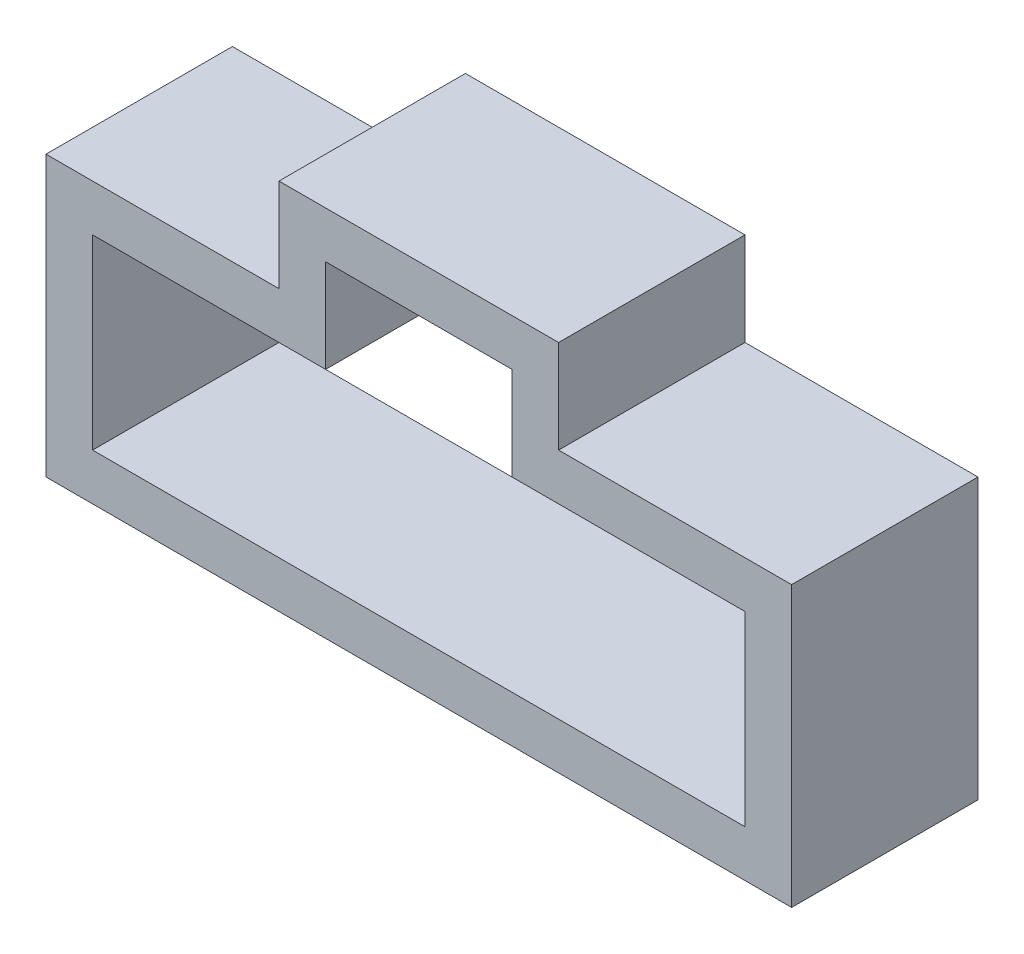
from build123d import *

# Parameters (mm, degrees)
EXTRUDE_THIN1_DEPTH = 10


with BuildPart() as part:
    # Sketch1 → Extrude-Thin1 (new, symmetric)
    with BuildSketch(Plane.XY):
        Polygon((-2.5, -2.5), (-2.5, 27.5), (22.5, 27.5), (22.5, 37.5), (52.5, 37.5), (52.5, 27.5), (77.5, 27.5), (77.5, -2.5), align=None)
        Polygon((2.5, 2.5), (2.5, 22.5), (27.5, 22.5), (27.5, 32.5), (47.5, 32.5), (47.5, 22.5), (72.5, 22.5), (72.5, 2.5), align=None, mode=Mode.SUBTRACT)
    extrude(amount=EXTRUDE_THIN1_DEPTH, both=True)


solid = part.part
